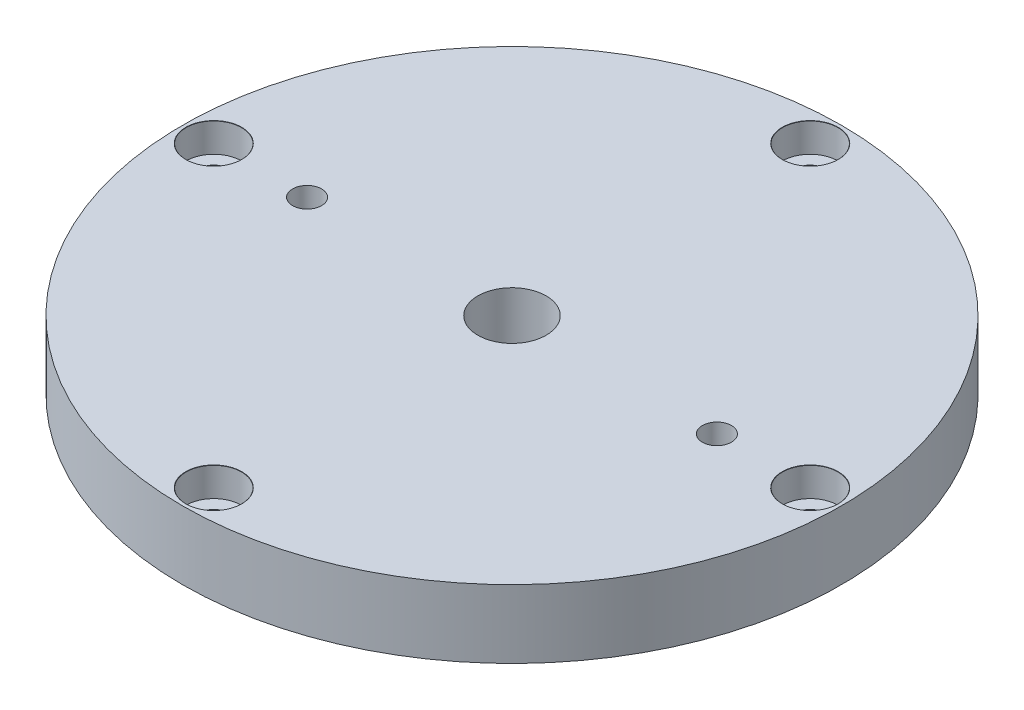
from build123d import *

# Parameters (mm, degrees)
SKETCH_1_R                  = 38.6
EXTRUDE_1_DEPTH             = 4
HOLE_WIZARD_M3_1_AT_2_COUNT = 2
HOLE_WIZARD_M3_1_AT_2_PITCH = 69.86
HOLE_WIZARD_M3_1_AT_3_COUNT = 2
HOLE_WIZARD_M3_1_AT_3_PITCH = 49.398479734
HOLE_WIZARD_M3_1_AT_4_COUNT = 2
HOLE_WIZARD_M3_1_AT_4_PITCH = 49.398479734
CUT_EXTRUDE_1_DEPTH         = 3
SKETCH_7_R                  = 1.7
CUT_EXTRUDE_2_DEPTH         = 55.817150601
SKETCH_8_R                  = 4
CUT_EXTRUDE_3_DEPTH         = 56.171731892
EXTRUDE_2_DEPTH             = 3


with BuildPart() as part:
    # Sketch 1 → Extrude 1 (new, symmetric)
    with BuildSketch(Plane(origin=(0, 0, 0), x_dir=(1, 0, 0), z_dir=(0, 1, 0))):
        with Locations(Location((0, 0, 0), (0, 0, 270))):
            Circle(SKETCH_1_R)
    extrude(amount=EXTRUDE_1_DEPTH, both=True)

    # Sketch 4 → Hole Wizard M3 _1 (revolve, cut)
    with BuildSketch(Plane(origin=(0, 4, -34.93), x_dir=(0, 0, 1), z_dir=(1, 0, 0))):
        Polygon((0, 0), (0, 8), (1.7, 8), (1.7, 3.4), (3.25, 3.4), (3.25, 0.025), (3.275, 0), align=None)
    hole_wizard_m3_1 = revolve(axis=Axis((0, 10.35, -34.93), (0, -1, 0)), mode=Mode.SUBTRACT)

    # Hole Wizard M3 _1 at 2: Hole Wizard M3 _1 ×2
    with Locations(*[(0, 0, i * HOLE_WIZARD_M3_1_AT_2_PITCH) for i in range(1, HOLE_WIZARD_M3_1_AT_2_COUNT)]):
        add(hole_wizard_m3_1, mode=Mode.SUBTRACT)

    # Hole Wizard M3 _1 at 3: Hole Wizard M3 _1 ×2
    with Locations(*[Vector(0.7071067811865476, 0, 0.7071067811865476) * (i * HOLE_WIZARD_M3_1_AT_3_PITCH) for i in range(1, HOLE_WIZARD_M3_1_AT_3_COUNT)]):
        add(hole_wizard_m3_1, mode=Mode.SUBTRACT)

    # Hole Wizard M3 _1 at 4: Hole Wizard M3 _1 ×2
    with Locations(*[Vector(-0.7071067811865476, 0, 0.7071067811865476) * (i * HOLE_WIZARD_M3_1_AT_4_PITCH) for i in range(1, HOLE_WIZARD_M3_1_AT_4_COUNT)]):
        add(hole_wizard_m3_1, mode=Mode.SUBTRACT)

    # Sketch 6 → Cut-Extrude 1 (cut)
    with BuildSketch(Plane.XZ.offset(4)):
        Polygon((24.000177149, 3.86724987), (20.649999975, 1.93322876), (20.6498228, -1.935120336), (23.9998228, -3.869448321), (27.349999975, -1.935427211), (27.350177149, 1.932921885), align=None)
        Polygon((-27.350177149, 1.932921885), (-24.000177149, 3.86724987), (-20.649999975, 1.93322876), (-20.6498228, -1.935120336), (-23.9998228, -3.869448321), (-27.349999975, -1.935427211), align=None)
    extrude(amount=-CUT_EXTRUDE_1_DEPTH, mode=Mode.SUBTRACT)

    # Sketch 7 → Cut-Extrude 2 (cut, through all)
    with BuildSketch(Plane.XZ.offset(1)):
        with Locations(Location((-24, 0, 0), (0, 0, 270))):
            Circle(SKETCH_7_R)
        with Locations(Location((24, 0, 0), (0, 0, 90))):
            Circle(SKETCH_7_R)
    extrude(amount=-CUT_EXTRUDE_2_DEPTH, mode=Mode.SUBTRACT)

    # Sketch 8 → Cut-Extrude 3 (cut, through all)
    with BuildSketch(Plane.XZ.offset(4)):
        with Locations(Location((0, 0, 0), (0, 0, 270))):
            Circle(SKETCH_8_R)
    extrude(amount=-CUT_EXTRUDE_3_DEPTH, mode=Mode.SUBTRACT)

    # Sketch 9 → Extrude 2 (add)
    # profile 1 of 2: a face of its own
    with BuildSketch(Plane.XZ.offset(1)):
        Polygon((24.000211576, 4.618802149), (20.000105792, 2.309584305), (19.999894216, -2.309217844), (23.999788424, -4.618802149), (27.999894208, -2.309584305), (28.000105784, 2.309217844), align=None)
        Polygon((24, 3.175426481), (21.25, 1.58771324), (21.25, -1.58771324), (24, -3.175426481), (26.75, -1.58771324), (26.75, 1.58771324), align=None, mode=Mode.SUBTRACT)
    # profile 2 of 2: a face of its own
    with BuildSketch(Plane.XZ.offset(1)):
        Polygon((-28.000105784, 2.309217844), (-24.000211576, 4.618802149), (-20.000105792, 2.309584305), (-19.999894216, -2.309217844), (-23.999788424, -4.618802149), (-27.999894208, -2.309584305), align=None)
        Polygon((-26.75, 1.58771324), (-24, 3.175426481), (-21.25, 1.58771324), (-21.25, -1.58771324), (-24, -3.175426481), (-26.75, -1.58771324), align=None, mode=Mode.SUBTRACT)
    extrude(amount=EXTRUDE_2_DEPTH)


solid = part.part
